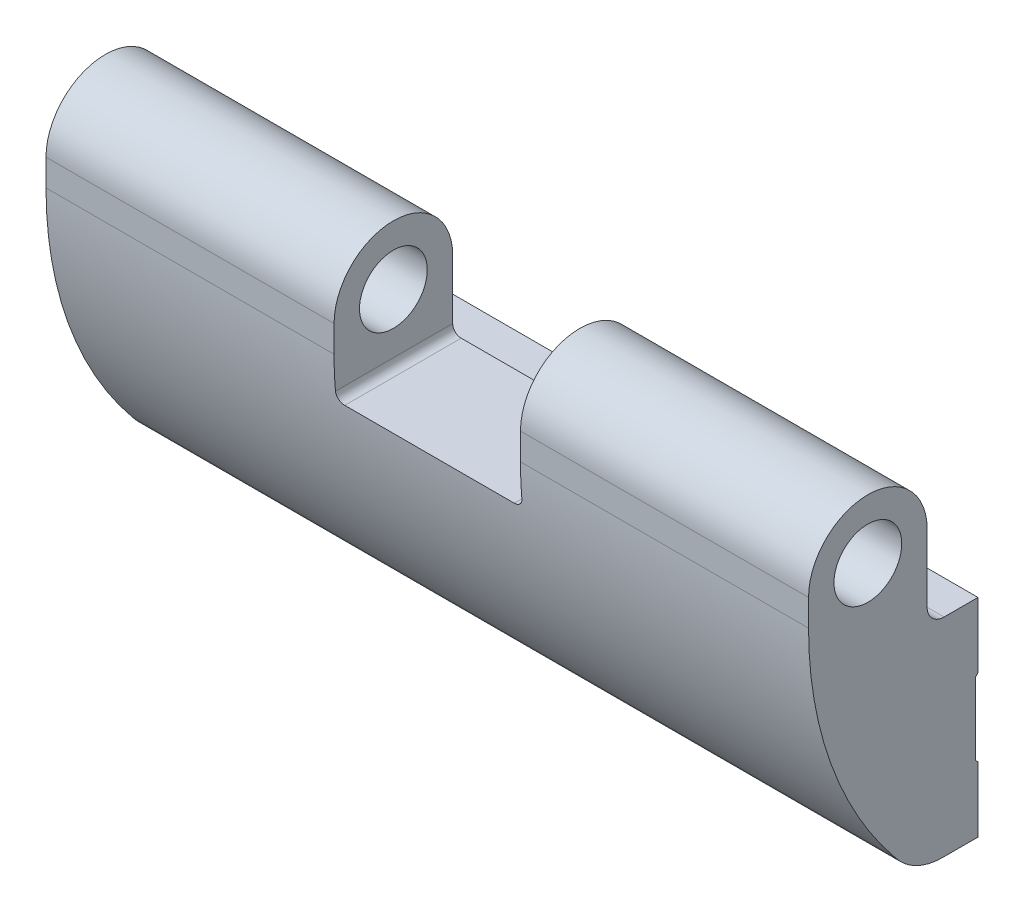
ISO-10303-21;
HEADER;
FILE_DESCRIPTION(('STEP AP214'),'2;1');
FILE_NAME('part.step','',(''),(''),'','','');
FILE_SCHEMA(('AUTOMOTIVE_DESIGN { 1 0 10303 214 1 1 1 1 }'));
ENDSEC;
DATA;
#1=APPLICATION_CONTEXT('core data for automotive mechanical design processes');
#2=APPLICATION_PROTOCOL_DEFINITION('international standard','automotive_design',2000,#1);
#3=PRODUCT_CONTEXT('',#1,'mechanical');
#4=PRODUCT('Part','Part','',(#3));
#5=PRODUCT_RELATED_PRODUCT_CATEGORY('part','',(#4));
#6=PRODUCT_DEFINITION_FORMATION('','',#4);
#7=PRODUCT_DEFINITION_CONTEXT('part definition',#1,'design');
#8=PRODUCT_DEFINITION('design','',#6,#7);
#9=PRODUCT_DEFINITION_SHAPE('','',#8);
#10=(LENGTH_UNIT() NAMED_UNIT(*) SI_UNIT(.MILLI.,.METRE.));
#11=(NAMED_UNIT(*) PLANE_ANGLE_UNIT() SI_UNIT($,.RADIAN.));
#12=(NAMED_UNIT(*) SI_UNIT($,.STERADIAN.) SOLID_ANGLE_UNIT());
#13=UNCERTAINTY_MEASURE_WITH_UNIT(LENGTH_MEASURE(1.E-05),#10,'distance_accuracy_value','');
#14=(GEOMETRIC_REPRESENTATION_CONTEXT(3) GLOBAL_UNCERTAINTY_ASSIGNED_CONTEXT((#13)) GLOBAL_UNIT_ASSIGNED_CONTEXT((#10,
#11,#12)) REPRESENTATION_CONTEXT('',''));
#15=CARTESIAN_POINT('',(0.,0.,0.));
#16=DIRECTION('',(0.,0.,1.));
#17=DIRECTION('',(1.,0.,0.));
#18=AXIS2_PLACEMENT_3D('',#15,#16,#17);
#19=CARTESIAN_POINT('',(-10.,20.8580531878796,20.));
#20=DIRECTION('',(0.,0.,-1.));
#21=DIRECTION('',(1.,0.,0.));
#22=AXIS2_PLACEMENT_3D('',#19,#20,#21);
#23=PLANE('',#22);
#24=DIRECTION('',(0.,1.,0.));
#25=VECTOR('',#24,1.);
#26=CARTESIAN_POINT('',(46.,17.,20.));
#27=LINE('',#26,#25);
#28=CARTESIAN_POINT('',(46.,20.8580531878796,20.));
#29=VERTEX_POINT('',#28);
#30=CARTESIAN_POINT('',(46.,24.,20.));
#31=VERTEX_POINT('',#30);
#32=EDGE_CURVE('E155',#29,#31,#27,.T.);
#33=ORIENTED_EDGE('',*,*,#32,.F.);
#34=DIRECTION('',(1.,0.,0.));
#35=VECTOR('',#34,1.);
#36=CARTESIAN_POINT('',(-10.,20.8580531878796,20.));
#37=LINE('',#36,#35);
#38=CARTESIAN_POINT('',(80.,20.8580531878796,20.));
#39=VERTEX_POINT('',#38);
#40=EDGE_CURVE('E165',#29,#39,#37,.T.);
#41=ORIENTED_EDGE('',*,*,#40,.T.);
#42=DIRECTION('',(0.,1.,0.));
#43=VECTOR('',#42,1.);
#44=CARTESIAN_POINT('',(80.,20.8580531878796,20.));
#45=LINE('',#44,#43);
#46=CARTESIAN_POINT('',(80.,24.,20.));
#47=VERTEX_POINT('',#46);
#48=EDGE_CURVE('E307',#39,#47,#45,.T.);
#49=ORIENTED_EDGE('',*,*,#48,.T.);
#50=DIRECTION('',(1.,0.,0.));
#51=VECTOR('',#50,1.);
#52=CARTESIAN_POINT('',(-10.,24.,20.));
#53=LINE('',#52,#51);
#54=EDGE_CURVE('E167',#31,#47,#53,.T.);
#55=ORIENTED_EDGE('',*,*,#54,.F.);
#56=EDGE_LOOP('',(#33,#41,#49,#55));
#57=FACE_BOUND('',#56,.T.);
#58=ADVANCED_FACE('F14',(#57),#23,.F.);
#59=DIRECTION('',(0.,-1.,0.));
#60=VECTOR('',#59,1.);
#61=CARTESIAN_POINT('',(24.,31.,20.));
#62=LINE('',#61,#60);
#63=CARTESIAN_POINT('',(24.,24.,20.));
#64=VERTEX_POINT('',#63);
#65=CARTESIAN_POINT('',(24.,20.8580531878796,20.));
#66=VERTEX_POINT('',#65);
#67=EDGE_CURVE('E168',#64,#66,#62,.T.);
#68=ORIENTED_EDGE('',*,*,#67,.F.);
#69=CARTESIAN_POINT('',(-10.,24.,20.));
#70=VERTEX_POINT('',#69);
#71=EDGE_CURVE('E221',#70,#64,#53,.T.);
#72=ORIENTED_EDGE('',*,*,#71,.F.);
#73=DIRECTION('',(0.,1.,0.));
#74=VECTOR('',#73,1.);
#75=CARTESIAN_POINT('',(-10.,20.8580531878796,20.));
#76=LINE('',#75,#74);
#77=CARTESIAN_POINT('',(-10.,20.8580531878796,20.));
#78=VERTEX_POINT('',#77);
#79=EDGE_CURVE('E308',#78,#70,#76,.T.);
#80=ORIENTED_EDGE('',*,*,#79,.F.);
#81=EDGE_CURVE('E175',#78,#66,#37,.T.);
#82=ORIENTED_EDGE('',*,*,#81,.T.);
#83=EDGE_LOOP('',(#68,#72,#80,#82));
#84=FACE_BOUND('',#83,.T.);
#85=ADVANCED_FACE('F386',(#84),#23,.F.);
#86=CARTESIAN_POINT('',(-10.,24.,13.));
#87=DIRECTION('',(1.,0.,0.));
#88=DIRECTION('',(0.,1.,0.));
#89=AXIS2_PLACEMENT_3D('',#86,#87,#88);
#90=CYLINDRICAL_SURFACE('',#89,7.);
#91=CARTESIAN_POINT('',(46.,24.,13.));
#92=DIRECTION('',(-1.,0.,0.));
#93=DIRECTION('',(0.,-1.,0.));
#94=AXIS2_PLACEMENT_3D('',#91,#92,#93);
#95=CIRCLE('',#94,7.);
#96=CARTESIAN_POINT('',(46.,24.,5.99999999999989));
#97=VERTEX_POINT('',#96);
#98=EDGE_CURVE('E305',#31,#97,#95,.T.);
#99=ORIENTED_EDGE('',*,*,#98,.F.);
#100=ORIENTED_EDGE('',*,*,#54,.T.);
#101=CARTESIAN_POINT('',(80.,24.,12.9999999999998));
#102=DIRECTION('',(-1.,0.,0.));
#103=DIRECTION('',(0.,-1.,0.));
#104=AXIS2_PLACEMENT_3D('',#101,#102,#103);
#105=CIRCLE('',#104,7.);
#106=CARTESIAN_POINT('',(80.,24.,5.99999999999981));
#107=VERTEX_POINT('',#106);
#108=EDGE_CURVE('E336',#47,#107,#105,.T.);
#109=ORIENTED_EDGE('',*,*,#108,.T.);
#110=DIRECTION('',(1.,0.,0.));
#111=VECTOR('',#110,1.);
#112=CARTESIAN_POINT('',(-10.,24.,6.));
#113=LINE('',#112,#111);
#114=EDGE_CURVE('E217',#97,#107,#113,.T.);
#115=ORIENTED_EDGE('',*,*,#114,.F.);
#116=EDGE_LOOP('',(#99,#100,#109,#115));
#117=FACE_BOUND('',#116,.T.);
#118=ADVANCED_FACE('F391',(#117),#90,.T.);
#119=CARTESIAN_POINT('',(24.,24.,13.));
#120=DIRECTION('',(1.,0.,0.));
#121=DIRECTION('',(0.,1.,0.));
#122=AXIS2_PLACEMENT_3D('',#119,#120,#121);
#123=CIRCLE('',#122,7.);
#124=CARTESIAN_POINT('',(24.,24.,6.));
#125=VERTEX_POINT('',#124);
#126=EDGE_CURVE('E298',#125,#64,#123,.T.);
#127=ORIENTED_EDGE('',*,*,#126,.F.);
#128=CARTESIAN_POINT('',(-10.,24.,6.));
#129=VERTEX_POINT('',#128);
#130=EDGE_CURVE('E218',#129,#125,#113,.T.);
#131=ORIENTED_EDGE('',*,*,#130,.F.);
#132=CARTESIAN_POINT('',(-10.,24.,13.));
#133=DIRECTION('',(-1.,0.,0.));
#134=DIRECTION('',(0.,-1.,0.));
#135=AXIS2_PLACEMENT_3D('',#132,#133,#134);
#136=CIRCLE('',#135,7.);
#137=EDGE_CURVE('E311',#70,#129,#136,.T.);
#138=ORIENTED_EDGE('',*,*,#137,.F.);
#139=ORIENTED_EDGE('',*,*,#71,.T.);
#140=EDGE_LOOP('',(#127,#131,#138,#139));
#141=FACE_BOUND('',#140,.T.);
#142=ADVANCED_FACE('F397',(#141),#90,.T.);
#143=CARTESIAN_POINT('',(-10.,24.,6.));
#144=DIRECTION('',(0.,0.,1.));
#145=DIRECTION('',(-1.,0.,0.));
#146=AXIS2_PLACEMENT_3D('',#143,#144,#145);
#147=PLANE('',#146);
#148=DIRECTION('',(0.,1.,0.));
#149=VECTOR('',#148,1.);
#150=CARTESIAN_POINT('',(24.,24.,6.));
#151=LINE('',#150,#149);
#152=CARTESIAN_POINT('',(24.,17.,6.));
#153=VERTEX_POINT('',#152);
#154=EDGE_CURVE('E296',#153,#125,#151,.T.);
#155=ORIENTED_EDGE('',*,*,#154,.F.);
#156=CARTESIAN_POINT('',(25.,17.,6.));
#157=DIRECTION('',(0.,0.,1.));
#158=DIRECTION('',(-1.,0.,0.));
#159=AXIS2_PLACEMENT_3D('',#156,#157,#158);
#160=CIRCLE('',#159,1.);
#161=CARTESIAN_POINT('',(25.,16.,5.99999999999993));
#162=VERTEX_POINT('',#161);
#163=EDGE_CURVE('E275',#162,#153,#160,.F.);
#164=ORIENTED_EDGE('',*,*,#163,.F.);
#165=DIRECTION('',(1.,0.,0.));
#166=VECTOR('',#165,1.);
#167=CARTESIAN_POINT('',(-10.,16.,6.));
#168=LINE('',#167,#166);
#169=CARTESIAN_POINT('',(-10.,16.,6.));
#170=VERTEX_POINT('',#169);
#171=EDGE_CURVE('E214',#170,#162,#168,.T.);
#172=ORIENTED_EDGE('',*,*,#171,.F.);
#173=DIRECTION('',(0.,-1.,0.));
#174=VECTOR('',#173,1.);
#175=CARTESIAN_POINT('',(-10.,24.,6.));
#176=LINE('',#175,#174);
#177=EDGE_CURVE('E313',#129,#170,#176,.T.);
#178=ORIENTED_EDGE('',*,*,#177,.F.);
#179=ORIENTED_EDGE('',*,*,#130,.T.);
#180=EDGE_LOOP('',(#155,#164,#172,#178,#179));
#181=FACE_BOUND('',#180,.T.);
#182=ADVANCED_FACE('F371',(#181),#147,.F.);
#183=CARTESIAN_POINT('',(-10.,24.,13.));
#184=DIRECTION('',(1.,0.,0.));
#185=DIRECTION('',(0.,1.,0.));
#186=AXIS2_PLACEMENT_3D('',#183,#184,#185);
#187=CYLINDRICAL_SURFACE('',#186,4.);
#188=CARTESIAN_POINT('',(80.,24.,12.9999999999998));
#189=DIRECTION('',(-1.,0.,0.));
#190=DIRECTION('',(0.,-1.,0.));
#191=AXIS2_PLACEMENT_3D('',#188,#189,#190);
#192=CIRCLE('',#191,4.);
#193=CARTESIAN_POINT('',(80.,20.,12.9999999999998));
#194=VERTEX_POINT('',#193);
#195=EDGE_CURVE('E185',#194,#194,#192,.T.);
#196=ORIENTED_EDGE('',*,*,#195,.F.);
#197=EDGE_LOOP('',(#196));
#198=FACE_BOUND('',#197,.T.);
#199=CARTESIAN_POINT('',(46.,24.,13.));
#200=DIRECTION('',(-1.,0.,0.));
#201=DIRECTION('',(0.,-1.,0.));
#202=AXIS2_PLACEMENT_3D('',#199,#200,#201);
#203=CIRCLE('',#202,4.);
#204=CARTESIAN_POINT('',(46.,20.,13.));
#205=VERTEX_POINT('',#204);
#206=EDGE_CURVE('E300',#205,#205,#203,.T.);
#207=ORIENTED_EDGE('',*,*,#206,.T.);
#208=EDGE_LOOP('',(#207));
#209=FACE_BOUND('',#208,.T.);
#210=ADVANCED_FACE('F367',(#198,#209),#187,.F.);
#211=CARTESIAN_POINT('',(-10.,24.,13.));
#212=DIRECTION('',(-1.,0.,0.));
#213=DIRECTION('',(0.,-1.,0.));
#214=AXIS2_PLACEMENT_3D('',#211,#212,#213);
#215=CIRCLE('',#214,4.);
#216=CARTESIAN_POINT('',(-10.,20.,13.));
#217=VERTEX_POINT('',#216);
#218=EDGE_CURVE('E176',#217,#217,#215,.T.);
#219=ORIENTED_EDGE('',*,*,#218,.T.);
#220=EDGE_LOOP('',(#219));
#221=FACE_BOUND('',#220,.T.);
#222=CARTESIAN_POINT('',(24.,24.,13.));
#223=DIRECTION('',(1.,0.,0.));
#224=DIRECTION('',(0.,1.,0.));
#225=AXIS2_PLACEMENT_3D('',#222,#223,#224);
#226=CIRCLE('',#225,4.);
#227=CARTESIAN_POINT('',(24.,28.,13.));
#228=VERTEX_POINT('',#227);
#229=EDGE_CURVE('E293',#228,#228,#226,.T.);
#230=ORIENTED_EDGE('',*,*,#229,.T.);
#231=EDGE_LOOP('',(#230));
#232=FACE_BOUND('',#231,.T.);
#233=ADVANCED_FACE('F370',(#221,#232),#187,.F.);
#234=CARTESIAN_POINT('',(-10.,20.8580531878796,-25.));
#235=DIRECTION('',(1.,0.,0.));
#236=DIRECTION('',(0.,1.,0.));
#237=AXIS2_PLACEMENT_3D('',#234,#235,#236);
#238=CYLINDRICAL_SURFACE('',#237,45.);
#239=CARTESIAN_POINT('',(46.,20.8580531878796,-25.));
#240=DIRECTION('',(-1.,0.,0.));
#241=DIRECTION('',(0.,-1.,0.));
#242=AXIS2_PLACEMENT_3D('',#239,#240,#241);
#243=CIRCLE('',#242,45.);
#244=CARTESIAN_POINT('',(46.,17.,19.8343108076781));
#245=VERTEX_POINT('',#244);
#246=EDGE_CURVE('E9',#245,#29,#243,.T.);
#247=ORIENTED_EDGE('',*,*,#246,.F.);
#248=CARTESIAN_POINT('',(45.,16.,19.7370016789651));
#249=CARTESIAN_POINT('',(45.0280224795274,16.0000000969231,19.737001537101));
#250=CARTESIAN_POINT('',(45.0560314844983,16.0011786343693,19.7371296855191));
#251=CARTESIAN_POINT('',(45.1118479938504,16.0058797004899,19.7376398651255));
#252=CARTESIAN_POINT('',(45.1396555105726,16.0094020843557,19.7380218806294));
#253=CARTESIAN_POINT('',(45.2224180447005,16.0234487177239,19.7395428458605));
#254=CARTESIAN_POINT('',(45.2768169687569,16.0374525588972,19.7410567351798));
#255=CARTESIAN_POINT('',(45.3824737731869,16.0743377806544,19.7450154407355));
#256=CARTESIAN_POINT('',(45.4337303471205,16.0972228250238,19.7474606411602));
#257=CARTESIAN_POINT('',(45.5316681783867,16.151204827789,19.7531709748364));
#258=CARTESIAN_POINT('',(45.5783499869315,16.1823007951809,19.7564360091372));
#259=CARTESIAN_POINT('',(45.6659627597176,16.251913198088,19.7636537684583));
#260=CARTESIAN_POINT('',(45.7068768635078,16.2904506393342,19.7676084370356));
#261=CARTESIAN_POINT('',(45.7816713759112,16.3738008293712,19.7760341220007));
#262=CARTESIAN_POINT('',(45.8155502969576,16.418614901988,19.7805052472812));
#263=CARTESIAN_POINT('',(45.8754921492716,16.5135014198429,19.7898108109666));
#264=CARTESIAN_POINT('',(45.9015116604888,16.5636010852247,19.7946470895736));
#265=CARTESIAN_POINT('',(45.9447534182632,16.6674351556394,19.8044800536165));
#266=CARTESIAN_POINT('',(45.9619804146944,16.7211675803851,19.8094766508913));
#267=CARTESIAN_POINT('',(45.9830212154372,16.8126690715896,19.8178115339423));
#268=CARTESIAN_POINT('',(45.9893835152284,16.8498719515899,19.821154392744));
#269=CARTESIAN_POINT('',(45.9978725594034,16.9247100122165,19.8277841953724));
#270=CARTESIAN_POINT('',(46.0000051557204,16.9623445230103,19.8310712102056));
#271=CARTESIAN_POINT('',(46.,17.,19.8343108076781));
#272=B_SPLINE_CURVE_WITH_KNOTS('',3,(#248,#249,#250,#251,#252,#253,#254,#255,#256,#257,#258,
#259,#260,#261,#262,#263,#264,#265,#266,#267,#268,#269,#270,#271),.UNSPECIFIED.,.F.,.F.,(4,2,2,
2,2,2,2,2,2,2,2,4),(0.,0.0840156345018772,0.168026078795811,0.335739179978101,0.503521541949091,
0.671283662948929,0.839526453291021,1.00780478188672,1.17699645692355,1.34609663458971,
1.45954472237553,1.57283574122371),.UNSPECIFIED.);
#273=CARTESIAN_POINT('',(45.,16.,19.7370016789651));
#274=VERTEX_POINT('',#273);
#275=EDGE_CURVE('E224',#274,#245,#272,.T.);
#276=ORIENTED_EDGE('',*,*,#275,.F.);
#277=DIRECTION('',(1.,0.,0.));
#278=VECTOR('',#277,1.);
#279=CARTESIAN_POINT('',(-10.,16.,19.7370016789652));
#280=LINE('',#279,#278);
#281=CARTESIAN_POINT('',(25.,16.,19.7370016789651));
#282=VERTEX_POINT('',#281);
#283=EDGE_CURVE('E232',#282,#274,#280,.T.);
#284=ORIENTED_EDGE('',*,*,#283,.F.);
#285=CARTESIAN_POINT('',(24.,17.,19.8343108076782));
#286=CARTESIAN_POINT('',(24.000000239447,16.971758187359,19.8318807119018));
#287=CARTESIAN_POINT('',(24.0011971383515,16.9435322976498,19.8294247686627));
#288=CARTESIAN_POINT('',(24.0059712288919,16.8872870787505,19.8244778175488));
#289=CARTESIAN_POINT('',(24.0095483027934,16.8592677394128,19.8219868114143));
#290=CARTESIAN_POINT('',(24.0238153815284,16.7758653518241,19.8144936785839));
#291=CARTESIAN_POINT('',(24.0380413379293,16.7210475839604,19.8094636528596));
#292=CARTESIAN_POINT('',(24.075528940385,16.6145858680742,19.7995072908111));
#293=CARTESIAN_POINT('',(24.0987948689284,16.5629434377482,19.7945810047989));
#294=CARTESIAN_POINT('',(24.1537086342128,16.4642996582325,19.7850129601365));
#295=CARTESIAN_POINT('',(24.1853549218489,16.4172974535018,19.7803711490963));
#296=CARTESIAN_POINT('',(24.2561152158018,16.329313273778,19.7715587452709));
#297=CARTESIAN_POINT('',(24.2952230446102,16.2883263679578,19.767387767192));
#298=CARTESIAN_POINT('',(24.3798350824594,16.2134983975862,19.7596864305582));
#299=CARTESIAN_POINT('',(24.4253404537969,16.1796586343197,19.7561561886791));
#300=CARTESIAN_POINT('',(24.5212553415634,16.1202414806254,19.7499053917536));
#301=CARTESIAN_POINT('',(24.5716449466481,16.0946322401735,19.7471817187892));
#302=CARTESIAN_POINT('',(24.6760373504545,16.052257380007,19.7426506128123));
#303=CARTESIAN_POINT('',(24.7300377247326,16.0354858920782,19.7408425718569));
#304=CARTESIAN_POINT('',(24.8203298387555,16.0156080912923,19.7386945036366));
#305=CARTESIAN_POINT('',(24.8560345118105,16.0097586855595,19.7380606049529));
#306=CARTESIAN_POINT('',(24.9278209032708,16.0019552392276,19.7372140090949));
#307=CARTESIAN_POINT('',(24.9639020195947,15.9999957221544,19.7370007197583));
#308=CARTESIAN_POINT('',(25.,16.,19.7370016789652));
#309=B_SPLINE_CURVE_WITH_KNOTS('',3,(#285,#286,#287,#288,#289,#290,#291,#292,#293,#294,#295,
#296,#297,#298,#299,#300,#301,#302,#303,#304,#305,#306,#307,#308),.UNSPECIFIED.,.F.,.F.,(4,2,2,
2,2,2,2,2,2,2,2,4),(0.,0.0849861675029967,0.169968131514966,0.339663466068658,0.509439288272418,
0.679183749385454,0.848788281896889,1.01842366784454,1.18739447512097,1.35625294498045,
1.46461294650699,1.57282028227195),.UNSPECIFIED.);
#310=CARTESIAN_POINT('',(24.,17.,19.8343108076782));
#311=VERTEX_POINT('',#310);
#312=EDGE_CURVE('E257',#311,#282,#309,.T.);
#313=ORIENTED_EDGE('',*,*,#312,.F.);
#314=CARTESIAN_POINT('',(24.,20.8580531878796,-25.));
#315=DIRECTION('',(1.,0.,0.));
#316=DIRECTION('',(0.,1.,0.));
#317=AXIS2_PLACEMENT_3D('',#314,#315,#316);
#318=CIRCLE('',#317,45.);
#319=EDGE_CURVE('E21',#66,#311,#318,.T.);
#320=ORIENTED_EDGE('',*,*,#319,.F.);
#321=ORIENTED_EDGE('',*,*,#81,.F.);
#322=CARTESIAN_POINT('',(-10.,20.8580531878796,-25.));
#323=DIRECTION('',(-1.,0.,0.));
#324=DIRECTION('',(0.,-1.,0.));
#325=AXIS2_PLACEMENT_3D('',#322,#323,#324);
#326=CIRCLE('',#325,45.);
#327=CARTESIAN_POINT('',(-10.,-7.66,9.80977797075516));
#328=VERTEX_POINT('',#327);
#329=EDGE_CURVE('E181',#328,#78,#326,.T.);
#330=ORIENTED_EDGE('',*,*,#329,.F.);
#331=DIRECTION('',(1.,0.,0.));
#332=VECTOR('',#331,1.);
#333=CARTESIAN_POINT('',(-10.,-7.66,9.80977797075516));
#334=LINE('',#333,#332);
#335=CARTESIAN_POINT('',(80.,-7.66,9.80977797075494));
#336=VERTEX_POINT('',#335);
#337=EDGE_CURVE('E179',#328,#336,#334,.T.);
#338=ORIENTED_EDGE('',*,*,#337,.T.);
#339=CARTESIAN_POINT('',(80.,20.8580531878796,-25.));
#340=DIRECTION('',(-1.,0.,0.));
#341=DIRECTION('',(0.,-1.,0.));
#342=AXIS2_PLACEMENT_3D('',#339,#340,#341);
#343=CIRCLE('',#342,45.);
#344=EDGE_CURVE('E173',#336,#39,#343,.T.);
#345=ORIENTED_EDGE('',*,*,#344,.T.);
#346=ORIENTED_EDGE('',*,*,#40,.F.);
#347=EDGE_LOOP('',(#247,#276,#284,#313,#320,#321,#330,#338,#345,#346));
#348=FACE_BOUND('',#347,.T.);
#349=ADVANCED_FACE('F170',(#348),#238,.T.);
#350=DIRECTION('',(0.,-1.,0.));
#351=VECTOR('',#350,1.);
#352=CARTESIAN_POINT('',(46.,24.,5.99999999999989));
#353=LINE('',#352,#351);
#354=CARTESIAN_POINT('',(46.,17.,5.99999999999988));
#355=VERTEX_POINT('',#354);
#356=EDGE_CURVE('E303',#97,#355,#353,.T.);
#357=ORIENTED_EDGE('',*,*,#356,.F.);
#358=ORIENTED_EDGE('',*,*,#114,.T.);
#359=DIRECTION('',(0.,-1.,0.));
#360=VECTOR('',#359,1.);
#361=CARTESIAN_POINT('',(80.,24.,5.99999999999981));
#362=LINE('',#361,#360);
#363=CARTESIAN_POINT('',(80.,16.,5.9999999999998));
#364=VERTEX_POINT('',#363);
#365=EDGE_CURVE('E339',#107,#364,#362,.T.);
#366=ORIENTED_EDGE('',*,*,#365,.T.);
#367=CARTESIAN_POINT('',(45.,16.,5.99999999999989));
#368=VERTEX_POINT('',#367);
#369=EDGE_CURVE('E213',#368,#364,#168,.T.);
#370=ORIENTED_EDGE('',*,*,#369,.F.);
#371=CARTESIAN_POINT('',(45.,17.,5.99999999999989));
#372=DIRECTION('',(0.,0.,1.));
#373=DIRECTION('',(-1.,0.,0.));
#374=AXIS2_PLACEMENT_3D('',#371,#372,#373);
#375=CIRCLE('',#374,1.);
#376=EDGE_CURVE('E276',#355,#368,#375,.F.);
#377=ORIENTED_EDGE('',*,*,#376,.F.);
#378=EDGE_LOOP('',(#357,#358,#366,#370,#377));
#379=FACE_BOUND('',#378,.T.);
#380=ADVANCED_FACE('F418',(#379),#147,.F.);
#381=CARTESIAN_POINT('',(-10.,16.,4.));
#382=DIRECTION('',(1.,0.,0.));
#383=DIRECTION('',(0.,1.,0.));
#384=AXIS2_PLACEMENT_3D('',#381,#382,#383);
#385=CYLINDRICAL_SURFACE('',#384,2.);
#386=CARTESIAN_POINT('',(80.,16.,3.9999999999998));
#387=DIRECTION('',(-1.,0.,0.));
#388=DIRECTION('',(0.,-1.,0.));
#389=AXIS2_PLACEMENT_3D('',#386,#387,#388);
#390=CIRCLE('',#389,2.);
#391=CARTESIAN_POINT('',(80.,14.,3.9999999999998));
#392=VERTEX_POINT('',#391);
#393=EDGE_CURVE('E342',#392,#364,#390,.T.);
#394=ORIENTED_EDGE('',*,*,#393,.F.);
#395=DIRECTION('',(1.,0.,0.));
#396=VECTOR('',#395,1.);
#397=CARTESIAN_POINT('',(-10.,14.,4.));
#398=LINE('',#397,#396);
#399=CARTESIAN_POINT('',(-10.,14.,4.));
#400=VERTEX_POINT('',#399);
#401=EDGE_CURVE('E211',#400,#392,#398,.T.);
#402=ORIENTED_EDGE('',*,*,#401,.F.);
#403=CARTESIAN_POINT('',(-10.,16.,4.));
#404=DIRECTION('',(-1.,0.,0.));
#405=DIRECTION('',(0.,-1.,0.));
#406=AXIS2_PLACEMENT_3D('',#403,#404,#405);
#407=CIRCLE('',#406,2.);
#408=EDGE_CURVE('E315',#400,#170,#407,.T.);
#409=ORIENTED_EDGE('',*,*,#408,.T.);
#410=ORIENTED_EDGE('',*,*,#171,.T.);
#411=DIRECTION('',(1.,0.,0.));
#412=VECTOR('',#411,1.);
#413=CARTESIAN_POINT('',(-10.,16.,6.));
#414=LINE('',#413,#412);
#415=EDGE_CURVE('E285',#162,#368,#414,.T.);
#416=ORIENTED_EDGE('',*,*,#415,.T.);
#417=ORIENTED_EDGE('',*,*,#369,.T.);
#418=EDGE_LOOP('',(#394,#402,#409,#410,#416,#417));
#419=FACE_BOUND('',#418,.T.);
#420=ADVANCED_FACE('F551',(#419),#385,.F.);
#421=CARTESIAN_POINT('',(-10.,14.,4.));
#422=DIRECTION('',(0.,-1.,0.));
#423=DIRECTION('',(1.,0.,0.));
#424=AXIS2_PLACEMENT_3D('',#421,#422,#423);
#425=PLANE('',#424);
#426=DIRECTION('',(0.,0.,-1.));
#427=VECTOR('',#426,1.);
#428=CARTESIAN_POINT('',(80.,14.,3.9999999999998));
#429=LINE('',#428,#427);
#430=CARTESIAN_POINT('',(80.,14.,-2.01413468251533E-13));
#431=VERTEX_POINT('',#430);
#432=EDGE_CURVE('E345',#392,#431,#429,.T.);
#433=ORIENTED_EDGE('',*,*,#432,.T.);
#434=DIRECTION('',(1.,0.,0.));
#435=VECTOR('',#434,1.);
#436=CARTESIAN_POINT('',(-10.,14.,0.));
#437=LINE('',#436,#435);
#438=CARTESIAN_POINT('',(-10.,14.,0.));
#439=VERTEX_POINT('',#438);
#440=EDGE_CURVE('E208',#439,#431,#437,.T.);
#441=ORIENTED_EDGE('',*,*,#440,.F.);
#442=DIRECTION('',(0.,0.,-1.));
#443=VECTOR('',#442,1.);
#444=CARTESIAN_POINT('',(-10.,14.,4.));
#445=LINE('',#444,#443);
#446=EDGE_CURVE('E318',#400,#439,#445,.T.);
#447=ORIENTED_EDGE('',*,*,#446,.F.);
#448=ORIENTED_EDGE('',*,*,#401,.T.);
#449=EDGE_LOOP('',(#433,#441,#447,#448));
#450=FACE_BOUND('',#449,.T.);
#451=ADVANCED_FACE('F559',(#450),#425,.F.);
#452=CARTESIAN_POINT('',(-10.,14.,0.));
#453=DIRECTION('',(0.,0.,1.));
#454=DIRECTION('',(-1.,0.,0.));
#455=AXIS2_PLACEMENT_3D('',#452,#453,#454);
#456=PLANE('',#455);
#457=DIRECTION('',(0.,-1.,0.));
#458=VECTOR('',#457,1.);
#459=CARTESIAN_POINT('',(80.,14.,-2.01413468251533E-13));
#460=LINE('',#459,#458);
#461=CARTESIAN_POINT('',(80.,6.3,-2.09675759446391E-13));
#462=VERTEX_POINT('',#461);
#463=EDGE_CURVE('E347',#431,#462,#460,.T.);
#464=ORIENTED_EDGE('',*,*,#463,.T.);
#465=DIRECTION('',(1.,0.,0.));
#466=VECTOR('',#465,1.);
#467=CARTESIAN_POINT('',(-10.,6.3,0.));
#468=LINE('',#467,#466);
#469=CARTESIAN_POINT('',(-10.,6.3,0.));
#470=VERTEX_POINT('',#469);
#471=EDGE_CURVE('E205',#470,#462,#468,.T.);
#472=ORIENTED_EDGE('',*,*,#471,.F.);
#473=DIRECTION('',(0.,-1.,0.));
#474=VECTOR('',#473,1.);
#475=CARTESIAN_POINT('',(-10.,14.,0.));
#476=LINE('',#475,#474);
#477=EDGE_CURVE('E320',#439,#470,#476,.T.);
#478=ORIENTED_EDGE('',*,*,#477,.F.);
#479=ORIENTED_EDGE('',*,*,#440,.T.);
#480=EDGE_LOOP('',(#464,#472,#478,#479));
#481=FACE_BOUND('',#480,.T.);
#482=ADVANCED_FACE('F568',(#481),#456,.F.);
#483=CARTESIAN_POINT('',(-10.,6.3,0.));
#484=DIRECTION('',(0.,0.707106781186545,0.707106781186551));
#485=DIRECTION('',(0.,0.707106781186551,-0.707106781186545));
#486=AXIS2_PLACEMENT_3D('',#483,#484,#485);
#487=PLANE('',#486);
#488=DIRECTION('',(0.,-0.70710678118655,0.707106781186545));
#489=VECTOR('',#488,1.);
#490=CARTESIAN_POINT('',(80.,6.3,-2.09675759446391E-13));
#491=LINE('',#490,#489);
#492=CARTESIAN_POINT('',(80.,6.,0.29999999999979));
#493=VERTEX_POINT('',#492);
#494=EDGE_CURVE('E349',#462,#493,#491,.T.);
#495=ORIENTED_EDGE('',*,*,#494,.T.);
#496=DIRECTION('',(1.,0.,0.));
#497=VECTOR('',#496,1.);
#498=CARTESIAN_POINT('',(-10.,6.,0.300000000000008));
#499=LINE('',#498,#497);
#500=CARTESIAN_POINT('',(-10.,6.,0.300000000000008));
#501=VERTEX_POINT('',#500);
#502=EDGE_CURVE('E201',#501,#493,#499,.T.);
#503=ORIENTED_EDGE('',*,*,#502,.F.);
#504=DIRECTION('',(0.,-0.70710678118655,0.707106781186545));
#505=VECTOR('',#504,1.);
#506=CARTESIAN_POINT('',(-10.,6.3,0.));
#507=LINE('',#506,#505);
#508=EDGE_CURVE('E322',#470,#501,#507,.T.);
#509=ORIENTED_EDGE('',*,*,#508,.F.);
#510=ORIENTED_EDGE('',*,*,#471,.T.);
#511=EDGE_LOOP('',(#495,#503,#509,#510));
#512=FACE_BOUND('',#511,.T.);
#513=ADVANCED_FACE('F577',(#512),#487,.F.);
#514=CARTESIAN_POINT('',(-10.,6.,0.300000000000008));
#515=DIRECTION('',(0.,0.,1.));
#516=DIRECTION('',(-1.,0.,0.));
#517=AXIS2_PLACEMENT_3D('',#514,#515,#516);
#518=PLANE('',#517);
#519=DIRECTION('',(1.,0.,0.));
#520=VECTOR('',#519,1.);
#521=CARTESIAN_POINT('',(-10.,-2.5,0.3));
#522=LINE('',#521,#520);
#523=CARTESIAN_POINT('',(70.,-2.5,0.299999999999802));
#524=VERTEX_POINT('',#523);
#525=CARTESIAN_POINT('',(80.,-2.5,0.299999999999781));
#526=VERTEX_POINT('',#525);
#527=EDGE_CURVE('E197',#524,#526,#522,.T.);
#528=ORIENTED_EDGE('',*,*,#527,.F.);
#529=CARTESIAN_POINT('',(70.,0.,0.299999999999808));
#530=DIRECTION('',(0.,0.,1.));
#531=DIRECTION('',(-1.,0.,0.));
#532=AXIS2_PLACEMENT_3D('',#529,#530,#531);
#533=CIRCLE('',#532,2.5);
#534=EDGE_CURVE('E26',#524,#524,#533,.T.);
#535=ORIENTED_EDGE('',*,*,#534,.T.);
#536=CARTESIAN_POINT('',(0.,-2.5,0.299999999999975));
#537=VERTEX_POINT('',#536);
#538=EDGE_CURVE('E202',#537,#524,#522,.T.);
#539=ORIENTED_EDGE('',*,*,#538,.F.);
#540=CARTESIAN_POINT('',(0.,0.,0.299999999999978));
#541=DIRECTION('',(0.,0.,1.));
#542=DIRECTION('',(-1.,0.,0.));
#543=AXIS2_PLACEMENT_3D('',#540,#541,#542);
#544=CIRCLE('',#543,2.5);
#545=EDGE_CURVE('E31',#537,#537,#544,.T.);
#546=ORIENTED_EDGE('',*,*,#545,.T.);
#547=CARTESIAN_POINT('',(-10.,-2.5,0.3));
#548=VERTEX_POINT('',#547);
#549=EDGE_CURVE('E198',#548,#537,#522,.T.);
#550=ORIENTED_EDGE('',*,*,#549,.F.);
#551=DIRECTION('',(0.,-1.,0.));
#552=VECTOR('',#551,1.);
#553=CARTESIAN_POINT('',(-10.,6.,0.300000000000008));
#554=LINE('',#553,#552);
#555=EDGE_CURVE('E324',#501,#548,#554,.T.);
#556=ORIENTED_EDGE('',*,*,#555,.F.);
#557=ORIENTED_EDGE('',*,*,#502,.T.);
#558=DIRECTION('',(0.,-1.,0.));
#559=VECTOR('',#558,1.);
#560=CARTESIAN_POINT('',(80.,6.,0.29999999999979));
#561=LINE('',#560,#559);
#562=EDGE_CURVE('E351',#493,#526,#561,.T.);
#563=ORIENTED_EDGE('',*,*,#562,.T.);
#564=EDGE_LOOP('',(#528,#535,#539,#546,#550,#556,#557,#563));
#565=FACE_BOUND('',#564,.T.);
#566=ADVANCED_FACE('F586',(#565),#518,.F.);
#567=CARTESIAN_POINT('',(-10.,-2.5,0.3));
#568=DIRECTION('',(0.,-0.707106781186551,0.707106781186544));
#569=DIRECTION('',(0.,0.707106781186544,0.707106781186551));
#570=AXIS2_PLACEMENT_3D('',#567,#568,#569);
#571=PLANE('',#570);
#572=DIRECTION('',(0.,-0.707106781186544,-0.707106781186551));
#573=VECTOR('',#572,1.);
#574=CARTESIAN_POINT('',(80.,-2.5,0.299999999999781));
#575=LINE('',#574,#573);
#576=CARTESIAN_POINT('',(80.,-2.8,-2.26541809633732E-13));
#577=VERTEX_POINT('',#576);
#578=EDGE_CURVE('E354',#526,#577,#575,.T.);
#579=ORIENTED_EDGE('',*,*,#578,.T.);
#580=DIRECTION('',(1.,0.,0.));
#581=VECTOR('',#580,1.);
#582=CARTESIAN_POINT('',(-10.,-2.8,0.));
#583=LINE('',#582,#581);
#584=CARTESIAN_POINT('',(-10.,-2.8,0.));
#585=VERTEX_POINT('',#584);
#586=EDGE_CURVE('E194',#585,#577,#583,.T.);
#587=ORIENTED_EDGE('',*,*,#586,.F.);
#588=DIRECTION('',(0.,-0.707106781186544,-0.707106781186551));
#589=VECTOR('',#588,1.);
#590=CARTESIAN_POINT('',(-10.,-2.5,0.3));
#591=LINE('',#590,#589);
#592=EDGE_CURVE('E326',#548,#585,#591,.T.);
#593=ORIENTED_EDGE('',*,*,#592,.F.);
#594=ORIENTED_EDGE('',*,*,#549,.T.);
#595=ORIENTED_EDGE('',*,*,#538,.T.);
#596=ORIENTED_EDGE('',*,*,#527,.T.);
#597=EDGE_LOOP('',(#579,#587,#593,#594,#595,#596));
#598=FACE_BOUND('',#597,.T.);
#599=ADVANCED_FACE('F595',(#598),#571,.F.);
#600=CARTESIAN_POINT('',(-10.,-2.8,0.));
#601=DIRECTION('',(0.,0.,1.));
#602=DIRECTION('',(0.,1.,0.));
#603=AXIS2_PLACEMENT_3D('',#600,#601,#602);
#604=PLANE('',#603);
#605=DIRECTION('',(0.,-1.,0.));
#606=VECTOR('',#605,1.);
#607=CARTESIAN_POINT('',(80.,-2.8,-2.26545712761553E-13));
#608=LINE('',#607,#606);
#609=CARTESIAN_POINT('',(80.,-10.5,-2.2770257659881E-13));
#610=VERTEX_POINT('',#609);
#611=EDGE_CURVE('E356',#577,#610,#608,.T.);
#612=ORIENTED_EDGE('',*,*,#611,.T.);
#613=DIRECTION('',(1.,0.,0.));
#614=VECTOR('',#613,1.);
#615=CARTESIAN_POINT('',(-10.,-10.5,0.));
#616=LINE('',#615,#614);
#617=CARTESIAN_POINT('',(-10.,-10.5,0.));
#618=VERTEX_POINT('',#617);
#619=EDGE_CURVE('E191',#618,#610,#616,.T.);
#620=ORIENTED_EDGE('',*,*,#619,.F.);
#621=DIRECTION('',(0.,-1.,0.));
#622=VECTOR('',#621,1.);
#623=CARTESIAN_POINT('',(-10.,-2.8,0.));
#624=LINE('',#623,#622);
#625=EDGE_CURVE('E328',#585,#618,#624,.T.);
#626=ORIENTED_EDGE('',*,*,#625,.F.);
#627=ORIENTED_EDGE('',*,*,#586,.T.);
#628=EDGE_LOOP('',(#612,#620,#626,#627));
#629=FACE_BOUND('',#628,.T.);
#630=ADVANCED_FACE('F604',(#629),#604,.F.);
#631=CARTESIAN_POINT('',(-10.,-10.5,0.));
#632=DIRECTION('',(0.,1.,0.));
#633=DIRECTION('',(-1.,0.,0.));
#634=AXIS2_PLACEMENT_3D('',#631,#632,#633);
#635=PLANE('',#634);
#636=DIRECTION('',(0.,0.,1.));
#637=VECTOR('',#636,1.);
#638=CARTESIAN_POINT('',(80.,-10.5,-2.2770257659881E-13));
#639=LINE('',#638,#637);
#640=CARTESIAN_POINT('',(80.,-10.5,4.17999999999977));
#641=VERTEX_POINT('',#640);
#642=EDGE_CURVE('E358',#610,#641,#639,.T.);
#643=ORIENTED_EDGE('',*,*,#642,.T.);
#644=DIRECTION('',(1.,0.,0.));
#645=VECTOR('',#644,1.);
#646=CARTESIAN_POINT('',(-10.,-10.5,4.18));
#647=LINE('',#646,#645);
#648=CARTESIAN_POINT('',(-10.,-10.5,4.18));
#649=VERTEX_POINT('',#648);
#650=EDGE_CURVE('E188',#649,#641,#647,.T.);
#651=ORIENTED_EDGE('',*,*,#650,.F.);
#652=DIRECTION('',(0.,0.,1.));
#653=VECTOR('',#652,1.);
#654=CARTESIAN_POINT('',(-10.,-10.5,0.));
#655=LINE('',#654,#653);
#656=EDGE_CURVE('E330',#618,#649,#655,.T.);
#657=ORIENTED_EDGE('',*,*,#656,.F.);
#658=ORIENTED_EDGE('',*,*,#619,.T.);
#659=EDGE_LOOP('',(#643,#651,#657,#658));
#660=FACE_BOUND('',#659,.T.);
#661=ADVANCED_FACE('F613',(#660),#635,.F.);
#662=CARTESIAN_POINT('',(-10.,-3.5,4.18));
#663=DIRECTION('',(1.,0.,0.));
#664=DIRECTION('',(0.,1.,0.));
#665=AXIS2_PLACEMENT_3D('',#662,#663,#664);
#666=CYLINDRICAL_SURFACE('',#665,7.);
#667=CARTESIAN_POINT('',(80.,-3.5,4.17999999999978));
#668=DIRECTION('',(-1.,0.,0.));
#669=DIRECTION('',(0.,-1.,0.));
#670=AXIS2_PLACEMENT_3D('',#667,#668,#669);
#671=CIRCLE('',#670,7.);
#672=EDGE_CURVE('E360',#641,#336,#671,.T.);
#673=ORIENTED_EDGE('',*,*,#672,.T.);
#674=ORIENTED_EDGE('',*,*,#337,.F.);
#675=CARTESIAN_POINT('',(-10.,-3.5,4.18));
#676=DIRECTION('',(-1.,0.,0.));
#677=DIRECTION('',(0.,-1.,0.));
#678=AXIS2_PLACEMENT_3D('',#675,#676,#677);
#679=CIRCLE('',#678,7.);
#680=EDGE_CURVE('E332',#649,#328,#679,.T.);
#681=ORIENTED_EDGE('',*,*,#680,.F.);
#682=ORIENTED_EDGE('',*,*,#650,.T.);
#683=EDGE_LOOP('',(#673,#674,#681,#682));
#684=FACE_BOUND('',#683,.T.);
#685=ADVANCED_FACE('F622',(#684),#666,.T.);
#686=CARTESIAN_POINT('',(-10.,24.,13.));
#687=DIRECTION('',(-1.,0.,0.));
#688=DIRECTION('',(0.,-1.,0.));
#689=AXIS2_PLACEMENT_3D('',#686,#687,#688);
#690=PLANE('',#689);
#691=ORIENTED_EDGE('',*,*,#218,.F.);
#692=EDGE_LOOP('',(#691));
#693=FACE_BOUND('',#692,.T.);
#694=ORIENTED_EDGE('',*,*,#79,.T.);
#695=ORIENTED_EDGE('',*,*,#137,.T.);
#696=ORIENTED_EDGE('',*,*,#177,.T.);
#697=ORIENTED_EDGE('',*,*,#408,.F.);
#698=ORIENTED_EDGE('',*,*,#446,.T.);
#699=ORIENTED_EDGE('',*,*,#477,.T.);
#700=ORIENTED_EDGE('',*,*,#508,.T.);
#701=ORIENTED_EDGE('',*,*,#555,.T.);
#702=ORIENTED_EDGE('',*,*,#592,.T.);
#703=ORIENTED_EDGE('',*,*,#625,.T.);
#704=ORIENTED_EDGE('',*,*,#656,.T.);
#705=ORIENTED_EDGE('',*,*,#680,.T.);
#706=ORIENTED_EDGE('',*,*,#329,.T.);
#707=EDGE_LOOP('',(#694,#695,#696,#697,#698,#699,#700,#701,#702,#703,#704,#705,#706));
#708=FACE_BOUND('',#707,.T.);
#709=ADVANCED_FACE('F382',(#693,#708),#690,.T.);
#710=CARTESIAN_POINT('',(80.,24.,12.9999999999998));
#711=DIRECTION('',(-1.,0.,0.));
#712=DIRECTION('',(0.,-1.,0.));
#713=AXIS2_PLACEMENT_3D('',#710,#711,#712);
#714=PLANE('',#713);
#715=ORIENTED_EDGE('',*,*,#195,.T.);
#716=EDGE_LOOP('',(#715));
#717=FACE_BOUND('',#716,.T.);
#718=ORIENTED_EDGE('',*,*,#48,.F.);
#719=ORIENTED_EDGE('',*,*,#344,.F.);
#720=ORIENTED_EDGE('',*,*,#672,.F.);
#721=ORIENTED_EDGE('',*,*,#642,.F.);
#722=ORIENTED_EDGE('',*,*,#611,.F.);
#723=ORIENTED_EDGE('',*,*,#578,.F.);
#724=ORIENTED_EDGE('',*,*,#562,.F.);
#725=ORIENTED_EDGE('',*,*,#494,.F.);
#726=ORIENTED_EDGE('',*,*,#463,.F.);
#727=ORIENTED_EDGE('',*,*,#432,.F.);
#728=ORIENTED_EDGE('',*,*,#393,.T.);
#729=ORIENTED_EDGE('',*,*,#365,.F.);
#730=ORIENTED_EDGE('',*,*,#108,.F.);
#731=EDGE_LOOP('',(#718,#719,#720,#721,#722,#723,#724,#725,#726,#727,#728,#729,#730));
#732=FACE_BOUND('',#731,.T.);
#733=ADVANCED_FACE('F364',(#717,#732),#714,.F.);
#734=CARTESIAN_POINT('',(46.,17.,20.));
#735=DIRECTION('',(-1.,0.,0.));
#736=DIRECTION('',(0.,-1.,0.));
#737=AXIS2_PLACEMENT_3D('',#734,#735,#736);
#738=PLANE('',#737);
#739=ORIENTED_EDGE('',*,*,#206,.F.);
#740=EDGE_LOOP('',(#739));
#741=FACE_BOUND('',#740,.T.);
#742=ORIENTED_EDGE('',*,*,#98,.T.);
#743=ORIENTED_EDGE('',*,*,#356,.T.);
#744=DIRECTION('',(0.,0.,-1.));
#745=VECTOR('',#744,1.);
#746=CARTESIAN_POINT('',(46.,17.,20.));
#747=LINE('',#746,#745);
#748=EDGE_CURVE('E158',#245,#355,#747,.T.);
#749=ORIENTED_EDGE('',*,*,#748,.F.);
#750=ORIENTED_EDGE('',*,*,#246,.T.);
#751=ORIENTED_EDGE('',*,*,#32,.T.);
#752=EDGE_LOOP('',(#742,#743,#749,#750,#751));
#753=FACE_BOUND('',#752,.T.);
#754=ADVANCED_FACE('F154',(#741,#753),#738,.T.);
#755=CARTESIAN_POINT('',(24.,31.,20.));
#756=DIRECTION('',(1.,0.,0.));
#757=DIRECTION('',(0.,1.,0.));
#758=AXIS2_PLACEMENT_3D('',#755,#756,#757);
#759=PLANE('',#758);
#760=ORIENTED_EDGE('',*,*,#229,.F.);
#761=EDGE_LOOP('',(#760));
#762=FACE_BOUND('',#761,.T.);
#763=ORIENTED_EDGE('',*,*,#126,.T.);
#764=ORIENTED_EDGE('',*,*,#67,.T.);
#765=ORIENTED_EDGE('',*,*,#319,.T.);
#766=DIRECTION('',(0.,0.,-1.));
#767=VECTOR('',#766,1.);
#768=CARTESIAN_POINT('',(24.,17.,20.));
#769=LINE('',#768,#767);
#770=EDGE_CURVE('E267',#311,#153,#769,.T.);
#771=ORIENTED_EDGE('',*,*,#770,.T.);
#772=ORIENTED_EDGE('',*,*,#154,.T.);
#773=EDGE_LOOP('',(#763,#764,#765,#771,#772));
#774=FACE_BOUND('',#773,.T.);
#775=ADVANCED_FACE('F254',(#762,#774),#759,.T.);
#776=CARTESIAN_POINT('',(25.,17.,20.));
#777=DIRECTION('',(0.,0.,-1.));
#778=DIRECTION('',(1.,0.,0.));
#779=AXIS2_PLACEMENT_3D('',#776,#777,#778);
#780=CYLINDRICAL_SURFACE('',#779,1.);
#781=ORIENTED_EDGE('',*,*,#163,.T.);
#782=ORIENTED_EDGE('',*,*,#770,.F.);
#783=ORIENTED_EDGE('',*,*,#312,.T.);
#784=DIRECTION('',(0.,0.,-1.));
#785=VECTOR('',#784,1.);
#786=CARTESIAN_POINT('',(25.,16.,20.));
#787=LINE('',#786,#785);
#788=EDGE_CURVE('E277',#282,#162,#787,.T.);
#789=ORIENTED_EDGE('',*,*,#788,.T.);
#790=EDGE_LOOP('',(#781,#782,#783,#789));
#791=FACE_BOUND('',#790,.T.);
#792=ADVANCED_FACE('F249',(#791),#780,.F.);
#793=CARTESIAN_POINT('',(25.,16.,20.));
#794=DIRECTION('',(0.,1.,0.));
#795=DIRECTION('',(-1.,0.,0.));
#796=AXIS2_PLACEMENT_3D('',#793,#794,#795);
#797=PLANE('',#796);
#798=ORIENTED_EDGE('',*,*,#788,.F.);
#799=ORIENTED_EDGE('',*,*,#283,.T.);
#800=DIRECTION('',(0.,0.,-1.));
#801=VECTOR('',#800,1.);
#802=CARTESIAN_POINT('',(45.,16.,20.));
#803=LINE('',#802,#801);
#804=EDGE_CURVE('E282',#274,#368,#803,.T.);
#805=ORIENTED_EDGE('',*,*,#804,.T.);
#806=ORIENTED_EDGE('',*,*,#415,.F.);
#807=EDGE_LOOP('',(#798,#799,#805,#806));
#808=FACE_BOUND('',#807,.T.);
#809=ADVANCED_FACE('F243',(#808),#797,.T.);
#810=CARTESIAN_POINT('',(45.,17.,20.));
#811=DIRECTION('',(0.,0.,-1.));
#812=DIRECTION('',(1.,0.,0.));
#813=AXIS2_PLACEMENT_3D('',#810,#811,#812);
#814=CYLINDRICAL_SURFACE('',#813,1.);
#815=ORIENTED_EDGE('',*,*,#376,.T.);
#816=ORIENTED_EDGE('',*,*,#804,.F.);
#817=ORIENTED_EDGE('',*,*,#275,.T.);
#818=ORIENTED_EDGE('',*,*,#748,.T.);
#819=EDGE_LOOP('',(#815,#816,#817,#818));
#820=FACE_BOUND('',#819,.T.);
#821=ADVANCED_FACE('F237',(#820),#814,.F.);
#822=CARTESIAN_POINT('',(70.,0.,9.99999999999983));
#823=DIRECTION('',(0.,0.,-1.));
#824=DIRECTION('',(0.,-1.,0.));
#825=AXIS2_PLACEMENT_3D('',#822,#823,#824);
#826=CYLINDRICAL_SURFACE('',#825,2.5);
#827=CARTESIAN_POINT('',(70.,0.,9.99999999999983));
#828=DIRECTION('',(0.,0.,-1.));
#829=DIRECTION('',(0.,-1.,0.));
#830=AXIS2_PLACEMENT_3D('',#827,#828,#829);
#831=CIRCLE('',#830,2.5);
#832=CARTESIAN_POINT('',(70.,-2.5,9.99999999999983));
#833=VERTEX_POINT('',#832);
#834=EDGE_CURVE('E422',#833,#833,#831,.T.);
#835=ORIENTED_EDGE('',*,*,#834,.F.);
#836=EDGE_LOOP('',(#835));
#837=FACE_BOUND('',#836,.T.);
#838=ORIENTED_EDGE('',*,*,#534,.F.);
#839=EDGE_LOOP('',(#838));
#840=FACE_BOUND('',#839,.T.);
#841=ADVANCED_FACE('F242',(#837,#840),#826,.F.);
#842=CARTESIAN_POINT('',(70.,0.,9.99999999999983));
#843=DIRECTION('',(0.,0.,-1.));
#844=DIRECTION('',(0.,-1.,0.));
#845=AXIS2_PLACEMENT_3D('',#842,#843,#844);
#846=PLANE('',#845);
#847=ORIENTED_EDGE('',*,*,#834,.T.);
#848=EDGE_LOOP('',(#847));
#849=FACE_BOUND('',#848,.T.);
#850=ADVANCED_FACE('F429',(#849),#846,.T.);
#851=CARTESIAN_POINT('',(0.,0.,10.));
#852=DIRECTION('',(0.,0.,-1.));
#853=DIRECTION('',(0.,-1.,0.));
#854=AXIS2_PLACEMENT_3D('',#851,#852,#853);
#855=CYLINDRICAL_SURFACE('',#854,2.5);
#856=CARTESIAN_POINT('',(0.,0.,10.));
#857=DIRECTION('',(0.,0.,-1.));
#858=DIRECTION('',(0.,-1.,0.));
#859=AXIS2_PLACEMENT_3D('',#856,#857,#858);
#860=CIRCLE('',#859,2.5);
#861=CARTESIAN_POINT('',(0.,-2.5,10.));
#862=VERTEX_POINT('',#861);
#863=EDGE_CURVE('E423',#862,#862,#860,.T.);
#864=ORIENTED_EDGE('',*,*,#863,.F.);
#865=EDGE_LOOP('',(#864));
#866=FACE_BOUND('',#865,.T.);
#867=ORIENTED_EDGE('',*,*,#545,.F.);
#868=EDGE_LOOP('',(#867));
#869=FACE_BOUND('',#868,.T.);
#870=ADVANCED_FACE('F245',(#866,#869),#855,.F.);
#871=CARTESIAN_POINT('',(0.,0.,10.));
#872=DIRECTION('',(0.,0.,-1.));
#873=DIRECTION('',(0.,-1.,0.));
#874=AXIS2_PLACEMENT_3D('',#871,#872,#873);
#875=PLANE('',#874);
#876=ORIENTED_EDGE('',*,*,#863,.T.);
#877=EDGE_LOOP('',(#876));
#878=FACE_BOUND('',#877,.T.);
#879=ADVANCED_FACE('F438',(#878),#875,.T.);
#880=CLOSED_SHELL('',(#58,#85,#118,#142,#182,#210,#233,#349,#380,#420,#451,#482,#513,#566,#599,
#630,#661,#685,#709,#733,#754,#775,#792,#809,#821,#841,#850,#870,#879));
#881=MANIFOLD_SOLID_BREP('B1',#880);
#882=ADVANCED_BREP_SHAPE_REPRESENTATION('',(#18,#881),#14);
#883=SHAPE_DEFINITION_REPRESENTATION(#9,#882);
ENDSEC;
END-ISO-10303-21;
